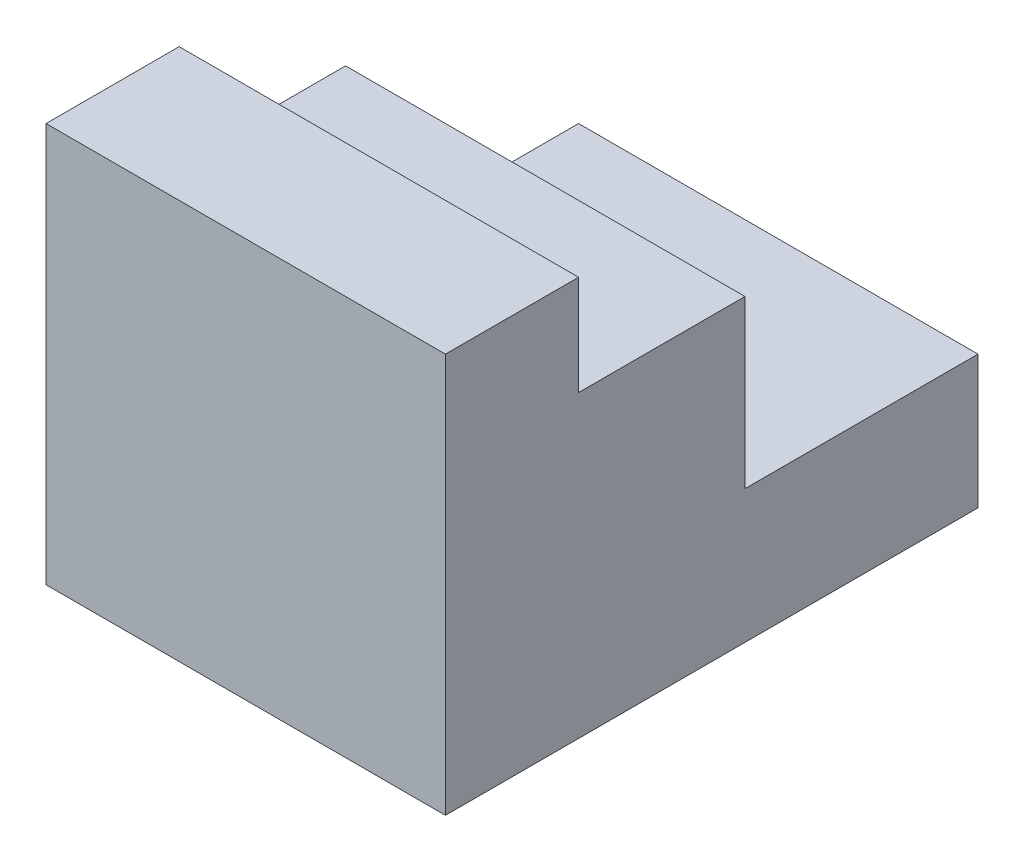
ISO-10303-21;
HEADER;
FILE_DESCRIPTION(('STEP AP214'),'2;1');
FILE_NAME('part.step','',(''),(''),'','','');
FILE_SCHEMA(('AUTOMOTIVE_DESIGN { 1 0 10303 214 1 1 1 1 }'));
ENDSEC;
DATA;
#1=APPLICATION_CONTEXT('core data for automotive mechanical design processes');
#2=APPLICATION_PROTOCOL_DEFINITION('international standard','automotive_design',2000,#1);
#3=PRODUCT_CONTEXT('',#1,'mechanical');
#4=PRODUCT('Part','Part','',(#3));
#5=PRODUCT_RELATED_PRODUCT_CATEGORY('part','',(#4));
#6=PRODUCT_DEFINITION_FORMATION('','',#4);
#7=PRODUCT_DEFINITION_CONTEXT('part definition',#1,'design');
#8=PRODUCT_DEFINITION('design','',#6,#7);
#9=PRODUCT_DEFINITION_SHAPE('','',#8);
#10=(LENGTH_UNIT() NAMED_UNIT(*) SI_UNIT(.MILLI.,.METRE.));
#11=(NAMED_UNIT(*) PLANE_ANGLE_UNIT() SI_UNIT($,.RADIAN.));
#12=(NAMED_UNIT(*) SI_UNIT($,.STERADIAN.) SOLID_ANGLE_UNIT());
#13=UNCERTAINTY_MEASURE_WITH_UNIT(LENGTH_MEASURE(1.E-05),#10,'distance_accuracy_value','');
#14=(GEOMETRIC_REPRESENTATION_CONTEXT(3) GLOBAL_UNCERTAINTY_ASSIGNED_CONTEXT((#13)) GLOBAL_UNIT_ASSIGNED_CONTEXT((#10,
#11,#12)) REPRESENTATION_CONTEXT('',''));
#15=CARTESIAN_POINT('',(0.,0.,0.));
#16=DIRECTION('',(0.,0.,1.));
#17=DIRECTION('',(1.,0.,0.));
#18=AXIS2_PLACEMENT_3D('',#15,#16,#17);
#19=CARTESIAN_POINT('',(60.,0.,-80.));
#20=DIRECTION('',(0.,1.,0.));
#21=DIRECTION('',(0.,0.,1.));
#22=AXIS2_PLACEMENT_3D('',#19,#20,#21);
#23=PLANE('',#22);
#24=DIRECTION('',(0.,0.,-1.));
#25=VECTOR('',#24,1.);
#26=CARTESIAN_POINT('',(0.,0.,-80.));
#27=LINE('',#26,#25);
#28=CARTESIAN_POINT('',(0.,0.,0.));
#29=VERTEX_POINT('',#28);
#30=CARTESIAN_POINT('',(0.,0.,-80.));
#31=VERTEX_POINT('',#30);
#32=EDGE_CURVE('E129',#29,#31,#27,.T.);
#33=ORIENTED_EDGE('',*,*,#32,.T.);
#34=DIRECTION('',(-1.,0.,0.));
#35=VECTOR('',#34,1.);
#36=CARTESIAN_POINT('',(60.,0.,-80.));
#37=LINE('',#36,#35);
#38=CARTESIAN_POINT('',(60.,0.,-80.));
#39=VERTEX_POINT('',#38);
#40=EDGE_CURVE('E11',#39,#31,#37,.T.);
#41=ORIENTED_EDGE('',*,*,#40,.F.);
#42=DIRECTION('',(0.,0.,-1.));
#43=VECTOR('',#42,1.);
#44=CARTESIAN_POINT('',(60.,0.,-80.));
#45=LINE('',#44,#43);
#46=CARTESIAN_POINT('',(60.,0.,0.));
#47=VERTEX_POINT('',#46);
#48=EDGE_CURVE('E143',#47,#39,#45,.T.);
#49=ORIENTED_EDGE('',*,*,#48,.F.);
#50=DIRECTION('',(-1.,0.,0.));
#51=VECTOR('',#50,1.);
#52=CARTESIAN_POINT('',(60.,0.,0.));
#53=LINE('',#52,#51);
#54=EDGE_CURVE('E125',#47,#29,#53,.T.);
#55=ORIENTED_EDGE('',*,*,#54,.T.);
#56=EDGE_LOOP('',(#33,#41,#49,#55));
#57=FACE_BOUND('',#56,.T.);
#58=ADVANCED_FACE('F33',(#57),#23,.F.);
#59=CARTESIAN_POINT('',(60.,20.,-80.));
#60=DIRECTION('',(0.,0.,1.));
#61=DIRECTION('',(1.,0.,0.));
#62=AXIS2_PLACEMENT_3D('',#59,#60,#61);
#63=PLANE('',#62);
#64=DIRECTION('',(0.,1.,0.));
#65=VECTOR('',#64,1.);
#66=CARTESIAN_POINT('',(0.,20.,-80.));
#67=LINE('',#66,#65);
#68=CARTESIAN_POINT('',(0.,20.,-80.));
#69=VERTEX_POINT('',#68);
#70=EDGE_CURVE('E132',#31,#69,#67,.T.);
#71=ORIENTED_EDGE('',*,*,#70,.T.);
#72=DIRECTION('',(-1.,0.,0.));
#73=VECTOR('',#72,1.);
#74=CARTESIAN_POINT('',(60.,20.,-80.));
#75=LINE('',#74,#73);
#76=CARTESIAN_POINT('',(60.,20.,-80.));
#77=VERTEX_POINT('',#76);
#78=EDGE_CURVE('E41',#77,#69,#75,.T.);
#79=ORIENTED_EDGE('',*,*,#78,.F.);
#80=DIRECTION('',(0.,1.,0.));
#81=VECTOR('',#80,1.);
#82=CARTESIAN_POINT('',(60.,20.,-80.));
#83=LINE('',#82,#81);
#84=EDGE_CURVE('E92',#39,#77,#83,.T.);
#85=ORIENTED_EDGE('',*,*,#84,.F.);
#86=ORIENTED_EDGE('',*,*,#40,.T.);
#87=EDGE_LOOP('',(#71,#79,#85,#86));
#88=FACE_BOUND('',#87,.T.);
#89=ADVANCED_FACE('F178',(#88),#63,.F.);
#90=CARTESIAN_POINT('',(60.,20.,-45.));
#91=DIRECTION('',(0.,-1.,0.));
#92=DIRECTION('',(0.,0.,-1.));
#93=AXIS2_PLACEMENT_3D('',#90,#91,#92);
#94=PLANE('',#93);
#95=DIRECTION('',(0.,0.,1.));
#96=VECTOR('',#95,1.);
#97=CARTESIAN_POINT('',(0.,20.,-45.));
#98=LINE('',#97,#96);
#99=CARTESIAN_POINT('',(0.,20.,-45.));
#100=VERTEX_POINT('',#99);
#101=EDGE_CURVE('E134',#69,#100,#98,.T.);
#102=ORIENTED_EDGE('',*,*,#101,.T.);
#103=DIRECTION('',(-1.,0.,0.));
#104=VECTOR('',#103,1.);
#105=CARTESIAN_POINT('',(60.,20.,-45.));
#106=LINE('',#105,#104);
#107=CARTESIAN_POINT('',(60.,20.,-45.));
#108=VERTEX_POINT('',#107);
#109=EDGE_CURVE('E150',#108,#100,#106,.T.);
#110=ORIENTED_EDGE('',*,*,#109,.F.);
#111=DIRECTION('',(0.,0.,1.));
#112=VECTOR('',#111,1.);
#113=CARTESIAN_POINT('',(60.,20.,-45.));
#114=LINE('',#113,#112);
#115=EDGE_CURVE('E158',#77,#108,#114,.T.);
#116=ORIENTED_EDGE('',*,*,#115,.F.);
#117=ORIENTED_EDGE('',*,*,#78,.T.);
#118=EDGE_LOOP('',(#102,#110,#116,#117));
#119=FACE_BOUND('',#118,.T.);
#120=ADVANCED_FACE('F156',(#119),#94,.F.);
#121=CARTESIAN_POINT('',(60.,45.,-45.));
#122=DIRECTION('',(0.,0.,1.));
#123=DIRECTION('',(0.,-1.,0.));
#124=AXIS2_PLACEMENT_3D('',#121,#122,#123);
#125=PLANE('',#124);
#126=DIRECTION('',(0.,1.,0.));
#127=VECTOR('',#126,1.);
#128=CARTESIAN_POINT('',(0.,45.,-45.));
#129=LINE('',#128,#127);
#130=CARTESIAN_POINT('',(0.,45.,-45.));
#131=VERTEX_POINT('',#130);
#132=EDGE_CURVE('E136',#100,#131,#129,.T.);
#133=ORIENTED_EDGE('',*,*,#132,.T.);
#134=DIRECTION('',(-1.,0.,0.));
#135=VECTOR('',#134,1.);
#136=CARTESIAN_POINT('',(60.,45.,-45.));
#137=LINE('',#136,#135);
#138=CARTESIAN_POINT('',(60.,45.,-45.));
#139=VERTEX_POINT('',#138);
#140=EDGE_CURVE('E147',#139,#131,#137,.T.);
#141=ORIENTED_EDGE('',*,*,#140,.F.);
#142=DIRECTION('',(0.,1.,0.));
#143=VECTOR('',#142,1.);
#144=CARTESIAN_POINT('',(60.,45.,-45.));
#145=LINE('',#144,#143);
#146=EDGE_CURVE('E170',#108,#139,#145,.T.);
#147=ORIENTED_EDGE('',*,*,#146,.F.);
#148=ORIENTED_EDGE('',*,*,#109,.T.);
#149=EDGE_LOOP('',(#133,#141,#147,#148));
#150=FACE_BOUND('',#149,.T.);
#151=ADVANCED_FACE('F166',(#150),#125,.F.);
#152=CARTESIAN_POINT('',(60.,45.,-20.));
#153=DIRECTION('',(0.,-1.,0.));
#154=DIRECTION('',(0.,0.,-1.));
#155=AXIS2_PLACEMENT_3D('',#152,#153,#154);
#156=PLANE('',#155);
#157=DIRECTION('',(0.,0.,1.));
#158=VECTOR('',#157,1.);
#159=CARTESIAN_POINT('',(0.,45.,-20.));
#160=LINE('',#159,#158);
#161=CARTESIAN_POINT('',(0.,45.,-20.));
#162=VERTEX_POINT('',#161);
#163=EDGE_CURVE('E138',#131,#162,#160,.T.);
#164=ORIENTED_EDGE('',*,*,#163,.T.);
#165=DIRECTION('',(-1.,0.,0.));
#166=VECTOR('',#165,1.);
#167=CARTESIAN_POINT('',(60.,45.,-20.));
#168=LINE('',#167,#166);
#169=CARTESIAN_POINT('',(60.,45.,-20.));
#170=VERTEX_POINT('',#169);
#171=EDGE_CURVE('E120',#170,#162,#168,.T.);
#172=ORIENTED_EDGE('',*,*,#171,.F.);
#173=DIRECTION('',(0.,0.,1.));
#174=VECTOR('',#173,1.);
#175=CARTESIAN_POINT('',(60.,45.,-20.));
#176=LINE('',#175,#174);
#177=EDGE_CURVE('E111',#139,#170,#176,.T.);
#178=ORIENTED_EDGE('',*,*,#177,.F.);
#179=ORIENTED_EDGE('',*,*,#140,.T.);
#180=EDGE_LOOP('',(#164,#172,#178,#179));
#181=FACE_BOUND('',#180,.T.);
#182=ADVANCED_FACE('F169',(#181),#156,.F.);
#183=CARTESIAN_POINT('',(60.,60.,-20.));
#184=DIRECTION('',(0.,0.,1.));
#185=DIRECTION('',(0.,-1.,0.));
#186=AXIS2_PLACEMENT_3D('',#183,#184,#185);
#187=PLANE('',#186);
#188=DIRECTION('',(0.,1.,0.));
#189=VECTOR('',#188,1.);
#190=CARTESIAN_POINT('',(0.,60.,-20.));
#191=LINE('',#190,#189);
#192=CARTESIAN_POINT('',(0.,60.,-20.));
#193=VERTEX_POINT('',#192);
#194=EDGE_CURVE('E119',#162,#193,#191,.T.);
#195=ORIENTED_EDGE('',*,*,#194,.T.);
#196=DIRECTION('',(-1.,0.,0.));
#197=VECTOR('',#196,1.);
#198=CARTESIAN_POINT('',(60.,60.,-20.));
#199=LINE('',#198,#197);
#200=CARTESIAN_POINT('',(60.,60.,-20.));
#201=VERTEX_POINT('',#200);
#202=EDGE_CURVE('E116',#201,#193,#199,.T.);
#203=ORIENTED_EDGE('',*,*,#202,.F.);
#204=DIRECTION('',(0.,1.,0.));
#205=VECTOR('',#204,1.);
#206=CARTESIAN_POINT('',(60.,60.,-20.));
#207=LINE('',#206,#205);
#208=EDGE_CURVE('E105',#170,#201,#207,.T.);
#209=ORIENTED_EDGE('',*,*,#208,.F.);
#210=ORIENTED_EDGE('',*,*,#171,.T.);
#211=EDGE_LOOP('',(#195,#203,#209,#210));
#212=FACE_BOUND('',#211,.T.);
#213=ADVANCED_FACE('F117',(#212),#187,.F.);
#214=CARTESIAN_POINT('',(60.,60.,0.));
#215=DIRECTION('',(0.,-1.,0.));
#216=DIRECTION('',(0.,0.,-1.));
#217=AXIS2_PLACEMENT_3D('',#214,#215,#216);
#218=PLANE('',#217);
#219=DIRECTION('',(0.,0.,1.));
#220=VECTOR('',#219,1.);
#221=CARTESIAN_POINT('',(0.,60.,0.));
#222=LINE('',#221,#220);
#223=CARTESIAN_POINT('',(0.,60.,0.));
#224=VERTEX_POINT('',#223);
#225=EDGE_CURVE('E78',#193,#224,#222,.T.);
#226=ORIENTED_EDGE('',*,*,#225,.T.);
#227=DIRECTION('',(-1.,0.,0.));
#228=VECTOR('',#227,1.);
#229=CARTESIAN_POINT('',(60.,60.,0.));
#230=LINE('',#229,#228);
#231=CARTESIAN_POINT('',(60.,60.,0.));
#232=VERTEX_POINT('',#231);
#233=EDGE_CURVE('E121',#232,#224,#230,.T.);
#234=ORIENTED_EDGE('',*,*,#233,.F.);
#235=DIRECTION('',(0.,0.,1.));
#236=VECTOR('',#235,1.);
#237=CARTESIAN_POINT('',(60.,60.,0.));
#238=LINE('',#237,#236);
#239=EDGE_CURVE('E109',#201,#232,#238,.T.);
#240=ORIENTED_EDGE('',*,*,#239,.F.);
#241=ORIENTED_EDGE('',*,*,#202,.T.);
#242=EDGE_LOOP('',(#226,#234,#240,#241));
#243=FACE_BOUND('',#242,.T.);
#244=ADVANCED_FACE('F123',(#243),#218,.F.);
#245=CARTESIAN_POINT('',(60.,0.,0.));
#246=DIRECTION('',(0.,0.,-1.));
#247=DIRECTION('',(-1.,0.,0.));
#248=AXIS2_PLACEMENT_3D('',#245,#246,#247);
#249=PLANE('',#248);
#250=DIRECTION('',(0.,-1.,0.));
#251=VECTOR('',#250,1.);
#252=CARTESIAN_POINT('',(0.,0.,0.));
#253=LINE('',#252,#251);
#254=EDGE_CURVE('E84',#224,#29,#253,.T.);
#255=ORIENTED_EDGE('',*,*,#254,.T.);
#256=ORIENTED_EDGE('',*,*,#54,.F.);
#257=DIRECTION('',(0.,-1.,0.));
#258=VECTOR('',#257,1.);
#259=CARTESIAN_POINT('',(60.,0.,0.));
#260=LINE('',#259,#258);
#261=EDGE_CURVE('E49',#232,#47,#260,.T.);
#262=ORIENTED_EDGE('',*,*,#261,.F.);
#263=ORIENTED_EDGE('',*,*,#233,.T.);
#264=EDGE_LOOP('',(#255,#256,#262,#263));
#265=FACE_BOUND('',#264,.T.);
#266=ADVANCED_FACE('F194',(#265),#249,.F.);
#267=CARTESIAN_POINT('',(60.,0.,0.));
#268=DIRECTION('',(-1.,0.,0.));
#269=DIRECTION('',(0.,0.,1.));
#270=AXIS2_PLACEMENT_3D('',#267,#268,#269);
#271=PLANE('',#270);
#272=ORIENTED_EDGE('',*,*,#48,.T.);
#273=ORIENTED_EDGE('',*,*,#84,.T.);
#274=ORIENTED_EDGE('',*,*,#115,.T.);
#275=ORIENTED_EDGE('',*,*,#146,.T.);
#276=ORIENTED_EDGE('',*,*,#177,.T.);
#277=ORIENTED_EDGE('',*,*,#208,.T.);
#278=ORIENTED_EDGE('',*,*,#239,.T.);
#279=ORIENTED_EDGE('',*,*,#261,.T.);
#280=EDGE_LOOP('',(#272,#273,#274,#275,#276,#277,#278,#279));
#281=FACE_BOUND('',#280,.T.);
#282=ADVANCED_FACE('F107',(#281),#271,.F.);
#283=CARTESIAN_POINT('',(0.,0.,0.));
#284=DIRECTION('',(-1.,0.,0.));
#285=DIRECTION('',(0.,0.,1.));
#286=AXIS2_PLACEMENT_3D('',#283,#284,#285);
#287=PLANE('',#286);
#288=ORIENTED_EDGE('',*,*,#32,.F.);
#289=ORIENTED_EDGE('',*,*,#254,.F.);
#290=ORIENTED_EDGE('',*,*,#225,.F.);
#291=ORIENTED_EDGE('',*,*,#194,.F.);
#292=ORIENTED_EDGE('',*,*,#163,.F.);
#293=ORIENTED_EDGE('',*,*,#132,.F.);
#294=ORIENTED_EDGE('',*,*,#101,.F.);
#295=ORIENTED_EDGE('',*,*,#70,.F.);
#296=EDGE_LOOP('',(#288,#289,#290,#291,#292,#293,#294,#295));
#297=FACE_BOUND('',#296,.T.);
#298=ADVANCED_FACE('F162',(#297),#287,.T.);
#299=CLOSED_SHELL('',(#58,#89,#120,#151,#182,#213,#244,#266,#282,#298));
#300=MANIFOLD_SOLID_BREP('B2',#299);
#301=ADVANCED_BREP_SHAPE_REPRESENTATION('',(#18,#300),#14);
#302=SHAPE_DEFINITION_REPRESENTATION(#9,#301);
ENDSEC;
END-ISO-10303-21;
